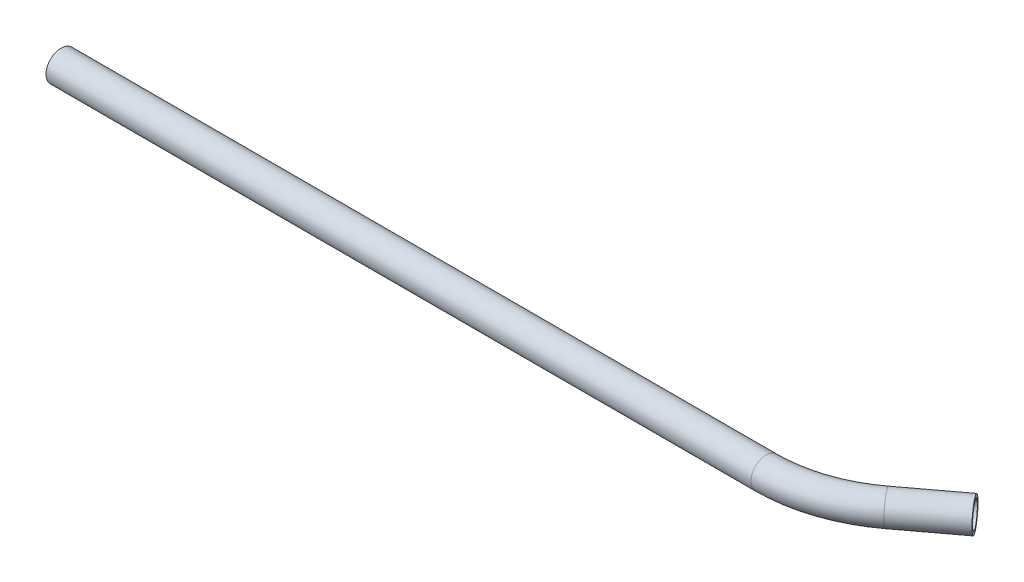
from build123d import *

# Parameters (mm, degrees)
ESQUISSE3_R   = 1
ESQUISSE3_R_2 = 0.8


with BuildPart() as part:
    # Balayage1: sweep along a path in Esquisse2
    with BuildLine(Plane(origin=(0, 0, 0), x_dir=(1, 0, 0), z_dir=(0, 1, 0))) as balayage1_path:
        Line((0, 0), (46.666666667, 0))
        ThreePointArc((46.666666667, 0), (49.828944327, 0.513167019), (52.666666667, 2))
        Line((52.666666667, 2), (56, 4.5))
    # Esquisse3 → Balayage1 (sweep)
    with BuildSketch(Plane(origin=(0, 0, 0), x_dir=(0, 0, -1), z_dir=(1, 0, 0))):
        Circle(ESQUISSE3_R)
        Circle(ESQUISSE3_R_2, mode=Mode.SUBTRACT)
    sweep(path=balayage1_path.line)


solid = part.part
